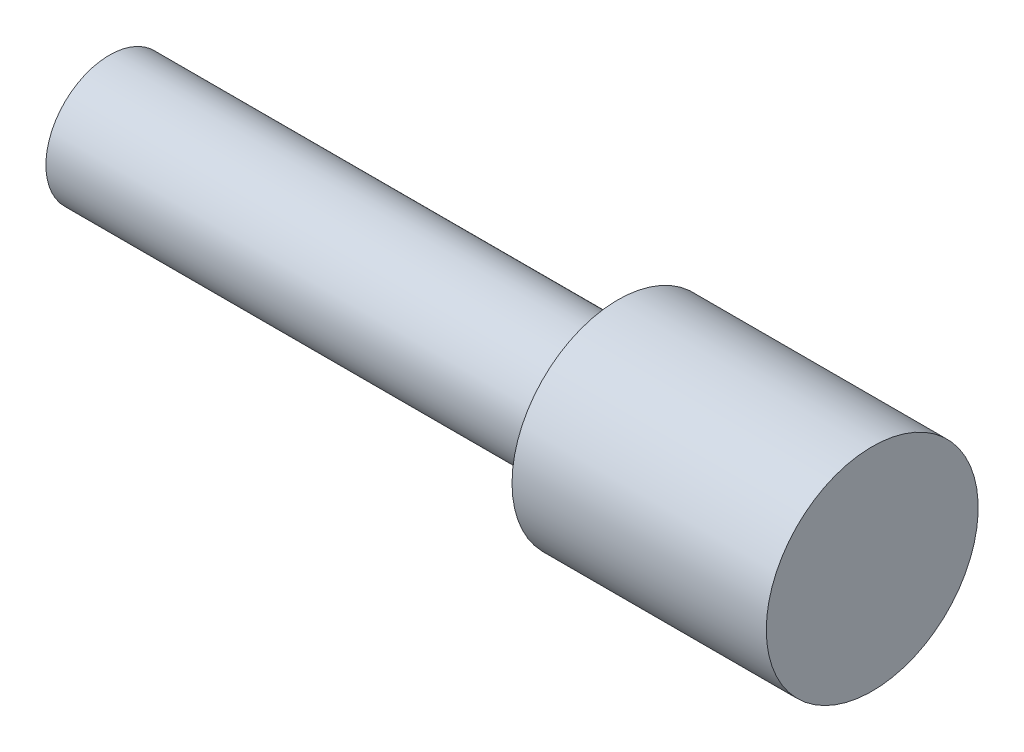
from build123d import *

# Parameters (mm, degrees)
SKETCH1_R           = 19.05
BOSS_EXTRUDE1_DEPTH = 152.4
SKETCH2_R           = 31.75
BOSS_EXTRUDE2_DEPTH = 76.2


with BuildPart() as part:
    # Sketch1 → Boss-Extrude1 (new body)
    with BuildSketch(Plane(origin=(0, 0, 0), x_dir=(0, 0, -1), z_dir=(1, 0, 0))):
        Circle(SKETCH1_R)
    extrude(amount=-BOSS_EXTRUDE1_DEPTH)

    # Sketch2 → Boss-Extrude2 (add)
    with BuildSketch(Plane(origin=(0, 0, 0), x_dir=(0, 0, -1), z_dir=(1, 0, 0))):
        with Locations(Location((0, 0, 0), (0, 0, 180))):
            Circle(SKETCH2_R)
    extrude(amount=BOSS_EXTRUDE2_DEPTH)


solid = part.part
